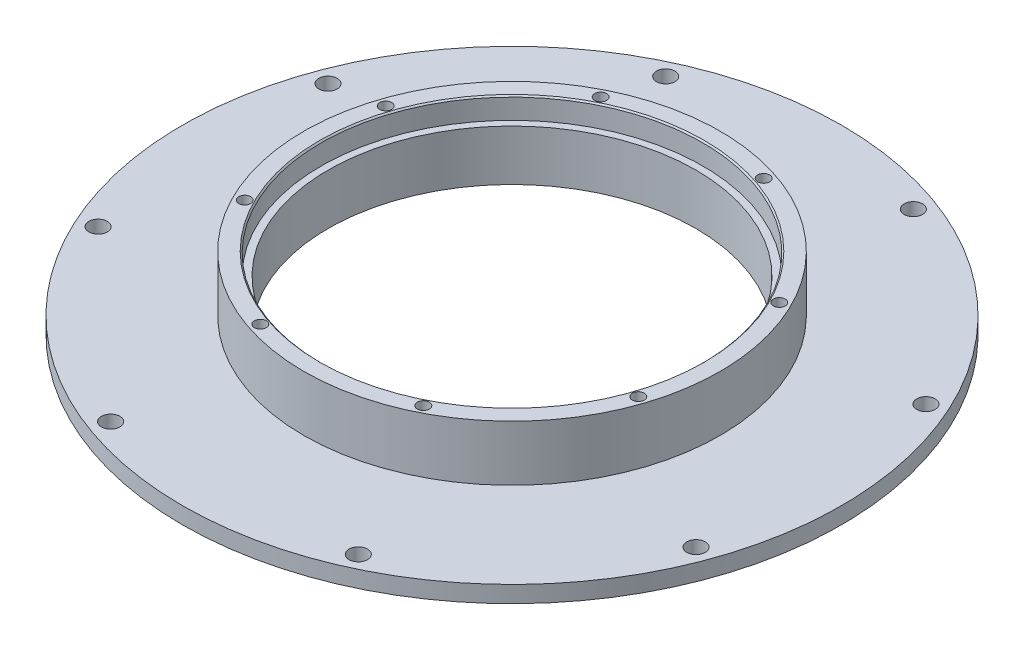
ISO-10303-21;
HEADER;
FILE_DESCRIPTION(('STEP AP214'),'2;1');
FILE_NAME('part.step','',(''),(''),'','','');
FILE_SCHEMA(('AUTOMOTIVE_DESIGN { 1 0 10303 214 1 1 1 1 }'));
ENDSEC;
DATA;
#1=APPLICATION_CONTEXT('core data for automotive mechanical design processes');
#2=APPLICATION_PROTOCOL_DEFINITION('international standard','automotive_design',2000,#1);
#3=PRODUCT_CONTEXT('',#1,'mechanical');
#4=PRODUCT('Part','Part','',(#3));
#5=PRODUCT_RELATED_PRODUCT_CATEGORY('part','',(#4));
#6=PRODUCT_DEFINITION_FORMATION('','',#4);
#7=PRODUCT_DEFINITION_CONTEXT('part definition',#1,'design');
#8=PRODUCT_DEFINITION('design','',#6,#7);
#9=PRODUCT_DEFINITION_SHAPE('','',#8);
#10=(LENGTH_UNIT() NAMED_UNIT(*) SI_UNIT(.MILLI.,.METRE.));
#11=(NAMED_UNIT(*) PLANE_ANGLE_UNIT() SI_UNIT($,.RADIAN.));
#12=(NAMED_UNIT(*) SI_UNIT($,.STERADIAN.) SOLID_ANGLE_UNIT());
#13=UNCERTAINTY_MEASURE_WITH_UNIT(LENGTH_MEASURE(1.E-05),#10,'distance_accuracy_value','');
#14=(GEOMETRIC_REPRESENTATION_CONTEXT(3) GLOBAL_UNCERTAINTY_ASSIGNED_CONTEXT((#13)) GLOBAL_UNIT_ASSIGNED_CONTEXT((#10,
#11,#12)) REPRESENTATION_CONTEXT('',''));
#15=CARTESIAN_POINT('',(0.,0.,0.));
#16=DIRECTION('',(0.,0.,1.));
#17=DIRECTION('',(1.,0.,0.));
#18=AXIS2_PLACEMENT_3D('',#15,#16,#17);
#19=CARTESIAN_POINT('',(0.,0.,0.));
#20=DIRECTION('',(0.,1.,0.));
#21=DIRECTION('',(0.,0.,1.));
#22=AXIS2_PLACEMENT_3D('',#19,#20,#21);
#23=CYLINDRICAL_SURFACE('',#22,67.31);
#24=CARTESIAN_POINT('',(0.,22.987,0.));
#25=DIRECTION('',(0.,1.,0.));
#26=DIRECTION('',(0.,0.,1.));
#27=AXIS2_PLACEMENT_3D('',#24,#25,#26);
#28=CIRCLE('',#27,67.31);
#29=CARTESIAN_POINT('',(0.,22.987,67.31));
#30=VERTEX_POINT('',#29);
#31=EDGE_CURVE('E167',#30,#30,#28,.F.);
#32=ORIENTED_EDGE('',*,*,#31,.F.);
#33=EDGE_LOOP('',(#32));
#34=FACE_BOUND('',#33,.T.);
#35=CARTESIAN_POINT('',(0.,4.445,0.));
#36=DIRECTION('',(0.,-1.,0.));
#37=DIRECTION('',(0.,0.,-1.));
#38=AXIS2_PLACEMENT_3D('',#35,#36,#37);
#39=CIRCLE('',#38,67.31);
#40=CARTESIAN_POINT('',(0.,4.445,-67.31));
#41=VERTEX_POINT('',#40);
#42=EDGE_CURVE('E44',#41,#41,#39,.F.);
#43=ORIENTED_EDGE('',*,*,#42,.F.);
#44=EDGE_LOOP('',(#43));
#45=FACE_BOUND('',#44,.T.);
#46=ADVANCED_FACE('F40',(#34,#45),#23,.F.);
#47=CARTESIAN_POINT('',(0.,30.861,0.));
#48=DIRECTION('',(0.,-1.,0.));
#49=DIRECTION('',(0.,0.,-1.));
#50=AXIS2_PLACEMENT_3D('',#47,#48,#49);
#51=CYLINDRICAL_SURFACE('',#50,120.65);
#52=CARTESIAN_POINT('',(0.,10.541,0.));
#53=DIRECTION('',(0.,1.,0.));
#54=DIRECTION('',(0.,0.,1.));
#55=AXIS2_PLACEMENT_3D('',#52,#53,#54);
#56=CIRCLE('',#55,120.65);
#57=CARTESIAN_POINT('',(0.,10.541,120.65));
#58=VERTEX_POINT('',#57);
#59=EDGE_CURVE('E161',#58,#58,#56,.T.);
#60=ORIENTED_EDGE('',*,*,#59,.F.);
#61=EDGE_LOOP('',(#60));
#62=FACE_BOUND('',#61,.T.);
#63=CARTESIAN_POINT('',(0.,4.445,0.));
#64=DIRECTION('',(0.,-1.,0.));
#65=DIRECTION('',(0.,0.,-1.));
#66=AXIS2_PLACEMENT_3D('',#63,#64,#65);
#67=CIRCLE('',#66,120.65);
#68=CARTESIAN_POINT('',(0.,4.445,-120.65));
#69=VERTEX_POINT('',#68);
#70=EDGE_CURVE('E91',#69,#69,#67,.T.);
#71=ORIENTED_EDGE('',*,*,#70,.F.);
#72=EDGE_LOOP('',(#71));
#73=FACE_BOUND('',#72,.T.);
#74=ADVANCED_FACE('F204',(#62,#73),#51,.T.);
#75=CARTESIAN_POINT('',(0.,0.,0.));
#76=DIRECTION('',(0.,1.,0.));
#77=DIRECTION('',(0.,0.,1.));
#78=AXIS2_PLACEMENT_3D('',#75,#76,#77);
#79=PLANE('',#78);
#80=CARTESIAN_POINT('',(0.,0.,0.));
#81=DIRECTION('',(0.,-1.,0.));
#82=DIRECTION('',(0.,0.,-1.));
#83=AXIS2_PLACEMENT_3D('',#80,#81,#82);
#84=CIRCLE('',#83,105.664);
#85=CARTESIAN_POINT('',(0.,0.,-105.664));
#86=VERTEX_POINT('',#85);
#87=EDGE_CURVE('E351',#86,#86,#84,.T.);
#88=ORIENTED_EDGE('',*,*,#87,.F.);
#89=EDGE_LOOP('',(#88));
#90=FACE_BOUND('',#89,.T.);
#91=CARTESIAN_POINT('',(0.,0.,0.));
#92=DIRECTION('',(0.,1.,0.));
#93=DIRECTION('',(0.,0.,1.));
#94=AXIS2_PLACEMENT_3D('',#91,#92,#93);
#95=CIRCLE('',#94,107.95);
#96=CARTESIAN_POINT('',(0.,0.,107.95));
#97=VERTEX_POINT('',#96);
#98=EDGE_CURVE('E49',#97,#97,#95,.F.);
#99=ORIENTED_EDGE('',*,*,#98,.T.);
#100=EDGE_LOOP('',(#99));
#101=FACE_BOUND('',#100,.T.);
#102=ADVANCED_FACE('F186',(#90,#101),#79,.F.);
#103=CARTESIAN_POINT('',(-39.7893544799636,10.541,107.150815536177));
#104=DIRECTION('',(0.,1.,0.));
#105=DIRECTION('',(0.,0.,1.));
#106=AXIS2_PLACEMENT_3D('',#103,#104,#105);
#107=CYLINDRICAL_SURFACE('',#106,3.3782);
#108=CARTESIAN_POINT('',(-39.7893544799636,10.541,107.150815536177));
#109=DIRECTION('',(0.,1.,0.));
#110=DIRECTION('',(0.,0.,1.));
#111=AXIS2_PLACEMENT_3D('',#108,#109,#110);
#112=CIRCLE('',#111,3.3782);
#113=CARTESIAN_POINT('',(-39.7893544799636,10.541,110.529015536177));
#114=VERTEX_POINT('',#113);
#115=EDGE_CURVE('E154',#114,#114,#112,.T.);
#116=ORIENTED_EDGE('',*,*,#115,.T.);
#117=EDGE_LOOP('',(#116));
#118=FACE_BOUND('',#117,.T.);
#119=CARTESIAN_POINT('',(-39.7893544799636,4.445,107.150815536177));
#120=DIRECTION('',(0.,-1.,0.));
#121=DIRECTION('',(0.,0.,-1.));
#122=AXIS2_PLACEMENT_3D('',#119,#120,#121);
#123=CIRCLE('',#122,3.3782);
#124=CARTESIAN_POINT('',(-39.7893544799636,4.445,103.772615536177));
#125=VERTEX_POINT('',#124);
#126=EDGE_CURVE('E374',#125,#125,#123,.F.);
#127=ORIENTED_EDGE('',*,*,#126,.F.);
#128=EDGE_LOOP('',(#127));
#129=FACE_BOUND('',#128,.T.);
#130=ADVANCED_FACE('F225',(#118,#129),#107,.F.);
#131=CARTESIAN_POINT('',(47.6317459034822,10.541,103.902390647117));
#132=DIRECTION('',(0.,1.,0.));
#133=DIRECTION('',(0.,0.,1.));
#134=AXIS2_PLACEMENT_3D('',#131,#132,#133);
#135=CYLINDRICAL_SURFACE('',#134,3.3782);
#136=CARTESIAN_POINT('',(47.6317459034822,10.541,103.902390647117));
#137=DIRECTION('',(0.,1.,0.));
#138=DIRECTION('',(0.,0.,1.));
#139=AXIS2_PLACEMENT_3D('',#136,#137,#138);
#140=CIRCLE('',#139,3.3782);
#141=CARTESIAN_POINT('',(47.6317459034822,10.541,107.280590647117));
#142=VERTEX_POINT('',#141);
#143=EDGE_CURVE('E151',#142,#142,#140,.T.);
#144=ORIENTED_EDGE('',*,*,#143,.T.);
#145=EDGE_LOOP('',(#144));
#146=FACE_BOUND('',#145,.T.);
#147=CARTESIAN_POINT('',(47.6317459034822,4.445,103.902390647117));
#148=DIRECTION('',(0.,-1.,0.));
#149=DIRECTION('',(0.,0.,-1.));
#150=AXIS2_PLACEMENT_3D('',#147,#148,#149);
#151=CIRCLE('',#150,3.3782);
#152=CARTESIAN_POINT('',(47.6317459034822,4.445,100.524190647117));
#153=VERTEX_POINT('',#152);
#154=EDGE_CURVE('E371',#153,#153,#151,.F.);
#155=ORIENTED_EDGE('',*,*,#154,.F.);
#156=EDGE_LOOP('',(#155));
#157=FACE_BOUND('',#156,.T.);
#158=ADVANCED_FACE('F261',(#146,#157),#135,.F.);
#159=CARTESIAN_POINT('',(107.150815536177,10.541,39.7893544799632));
#160=DIRECTION('',(0.,1.,0.));
#161=DIRECTION('',(0.,0.,1.));
#162=AXIS2_PLACEMENT_3D('',#159,#160,#161);
#163=CYLINDRICAL_SURFACE('',#162,3.3782);
#164=CARTESIAN_POINT('',(107.150815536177,10.541,39.7893544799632));
#165=DIRECTION('',(0.,1.,0.));
#166=DIRECTION('',(0.,0.,1.));
#167=AXIS2_PLACEMENT_3D('',#164,#165,#166);
#168=CIRCLE('',#167,3.3782);
#169=CARTESIAN_POINT('',(107.150815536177,10.541,43.1675544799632));
#170=VERTEX_POINT('',#169);
#171=EDGE_CURVE('E148',#170,#170,#168,.T.);
#172=ORIENTED_EDGE('',*,*,#171,.T.);
#173=EDGE_LOOP('',(#172));
#174=FACE_BOUND('',#173,.T.);
#175=CARTESIAN_POINT('',(107.150815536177,4.445,39.7893544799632));
#176=DIRECTION('',(0.,-1.,0.));
#177=DIRECTION('',(0.,0.,-1.));
#178=AXIS2_PLACEMENT_3D('',#175,#176,#177);
#179=CIRCLE('',#178,3.3782);
#180=CARTESIAN_POINT('',(107.150815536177,4.445,36.4111544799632));
#181=VERTEX_POINT('',#180);
#182=EDGE_CURVE('E368',#181,#181,#179,.F.);
#183=ORIENTED_EDGE('',*,*,#182,.F.);
#184=EDGE_LOOP('',(#183));
#185=FACE_BOUND('',#184,.T.);
#186=ADVANCED_FACE('F265',(#174,#185),#163,.F.);
#187=CARTESIAN_POINT('',(103.902390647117,10.541,-47.6317459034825));
#188=DIRECTION('',(0.,1.,0.));
#189=DIRECTION('',(0.,0.,1.));
#190=AXIS2_PLACEMENT_3D('',#187,#188,#189);
#191=CYLINDRICAL_SURFACE('',#190,3.3782);
#192=CARTESIAN_POINT('',(103.902390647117,10.541,-47.6317459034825));
#193=DIRECTION('',(0.,1.,0.));
#194=DIRECTION('',(0.,0.,1.));
#195=AXIS2_PLACEMENT_3D('',#192,#193,#194);
#196=CIRCLE('',#195,3.3782);
#197=CARTESIAN_POINT('',(103.902390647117,10.541,-44.2535459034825));
#198=VERTEX_POINT('',#197);
#199=EDGE_CURVE('E145',#198,#198,#196,.T.);
#200=ORIENTED_EDGE('',*,*,#199,.T.);
#201=EDGE_LOOP('',(#200));
#202=FACE_BOUND('',#201,.T.);
#203=CARTESIAN_POINT('',(103.902390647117,4.445,-47.6317459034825));
#204=DIRECTION('',(0.,-1.,0.));
#205=DIRECTION('',(0.,0.,-1.));
#206=AXIS2_PLACEMENT_3D('',#203,#204,#205);
#207=CIRCLE('',#206,3.3782);
#208=CARTESIAN_POINT('',(103.902390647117,4.445,-51.0099459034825));
#209=VERTEX_POINT('',#208);
#210=EDGE_CURVE('E365',#209,#209,#207,.F.);
#211=ORIENTED_EDGE('',*,*,#210,.F.);
#212=EDGE_LOOP('',(#211));
#213=FACE_BOUND('',#212,.T.);
#214=ADVANCED_FACE('F269',(#202,#213),#191,.F.);
#215=CARTESIAN_POINT('',(39.7893544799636,10.541,-107.150815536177));
#216=DIRECTION('',(0.,1.,0.));
#217=DIRECTION('',(0.,0.,1.));
#218=AXIS2_PLACEMENT_3D('',#215,#216,#217);
#219=CYLINDRICAL_SURFACE('',#218,3.3782);
#220=CARTESIAN_POINT('',(39.7893544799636,10.541,-107.150815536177));
#221=DIRECTION('',(0.,1.,0.));
#222=DIRECTION('',(0.,0.,1.));
#223=AXIS2_PLACEMENT_3D('',#220,#221,#222);
#224=CIRCLE('',#223,3.3782);
#225=CARTESIAN_POINT('',(39.7893544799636,10.541,-103.772615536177));
#226=VERTEX_POINT('',#225);
#227=EDGE_CURVE('E142',#226,#226,#224,.T.);
#228=ORIENTED_EDGE('',*,*,#227,.T.);
#229=EDGE_LOOP('',(#228));
#230=FACE_BOUND('',#229,.T.);
#231=CARTESIAN_POINT('',(39.7893544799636,4.445,-107.150815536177));
#232=DIRECTION('',(0.,-1.,0.));
#233=DIRECTION('',(0.,0.,-1.));
#234=AXIS2_PLACEMENT_3D('',#231,#232,#233);
#235=CIRCLE('',#234,3.3782);
#236=CARTESIAN_POINT('',(39.7893544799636,4.445,-110.529015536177));
#237=VERTEX_POINT('',#236);
#238=EDGE_CURVE('E362',#237,#237,#235,.F.);
#239=ORIENTED_EDGE('',*,*,#238,.F.);
#240=EDGE_LOOP('',(#239));
#241=FACE_BOUND('',#240,.T.);
#242=ADVANCED_FACE('F273',(#230,#241),#219,.F.);
#243=CARTESIAN_POINT('',(-47.6317459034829,10.541,-103.902390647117));
#244=DIRECTION('',(0.,1.,0.));
#245=DIRECTION('',(0.,0.,1.));
#246=AXIS2_PLACEMENT_3D('',#243,#244,#245);
#247=CYLINDRICAL_SURFACE('',#246,3.3782);
#248=CARTESIAN_POINT('',(-47.6317459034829,10.541,-103.902390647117));
#249=DIRECTION('',(0.,1.,0.));
#250=DIRECTION('',(0.,0.,1.));
#251=AXIS2_PLACEMENT_3D('',#248,#249,#250);
#252=CIRCLE('',#251,3.3782);
#253=CARTESIAN_POINT('',(-47.6317459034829,10.541,-100.524190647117));
#254=VERTEX_POINT('',#253);
#255=EDGE_CURVE('E139',#254,#254,#252,.T.);
#256=ORIENTED_EDGE('',*,*,#255,.T.);
#257=EDGE_LOOP('',(#256));
#258=FACE_BOUND('',#257,.T.);
#259=CARTESIAN_POINT('',(-47.6317459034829,4.445,-103.902390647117));
#260=DIRECTION('',(0.,-1.,0.));
#261=DIRECTION('',(0.,0.,-1.));
#262=AXIS2_PLACEMENT_3D('',#259,#260,#261);
#263=CIRCLE('',#262,3.3782);
#264=CARTESIAN_POINT('',(-47.6317459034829,4.445,-107.280590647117));
#265=VERTEX_POINT('',#264);
#266=EDGE_CURVE('E359',#265,#265,#263,.F.);
#267=ORIENTED_EDGE('',*,*,#266,.F.);
#268=EDGE_LOOP('',(#267));
#269=FACE_BOUND('',#268,.T.);
#270=ADVANCED_FACE('F277',(#258,#269),#247,.F.);
#271=CARTESIAN_POINT('',(-107.150815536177,10.541,-39.7893544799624));
#272=DIRECTION('',(0.,1.,0.));
#273=DIRECTION('',(0.,0.,1.));
#274=AXIS2_PLACEMENT_3D('',#271,#272,#273);
#275=CYLINDRICAL_SURFACE('',#274,3.3782);
#276=CARTESIAN_POINT('',(-107.150815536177,10.541,-39.7893544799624));
#277=DIRECTION('',(0.,1.,0.));
#278=DIRECTION('',(0.,0.,1.));
#279=AXIS2_PLACEMENT_3D('',#276,#277,#278);
#280=CIRCLE('',#279,3.3782);
#281=CARTESIAN_POINT('',(-107.150815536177,10.541,-36.4111544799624));
#282=VERTEX_POINT('',#281);
#283=EDGE_CURVE('E136',#282,#282,#280,.T.);
#284=ORIENTED_EDGE('',*,*,#283,.T.);
#285=EDGE_LOOP('',(#284));
#286=FACE_BOUND('',#285,.T.);
#287=CARTESIAN_POINT('',(-107.150815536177,4.445,-39.7893544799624));
#288=DIRECTION('',(0.,-1.,0.));
#289=DIRECTION('',(0.,0.,-1.));
#290=AXIS2_PLACEMENT_3D('',#287,#288,#289);
#291=CIRCLE('',#290,3.3782);
#292=CARTESIAN_POINT('',(-107.150815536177,4.445,-43.1675544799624));
#293=VERTEX_POINT('',#292);
#294=EDGE_CURVE('E181',#293,#293,#291,.F.);
#295=ORIENTED_EDGE('',*,*,#294,.F.);
#296=EDGE_LOOP('',(#295));
#297=FACE_BOUND('',#296,.T.);
#298=ADVANCED_FACE('F281',(#286,#297),#275,.F.);
#299=CARTESIAN_POINT('',(-103.902390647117,10.541,47.6317459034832));
#300=DIRECTION('',(0.,1.,0.));
#301=DIRECTION('',(0.,0.,1.));
#302=AXIS2_PLACEMENT_3D('',#299,#300,#301);
#303=CYLINDRICAL_SURFACE('',#302,3.3782);
#304=CARTESIAN_POINT('',(-103.902390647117,10.541,47.6317459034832));
#305=DIRECTION('',(0.,1.,0.));
#306=DIRECTION('',(0.,0.,1.));
#307=AXIS2_PLACEMENT_3D('',#304,#305,#306);
#308=CIRCLE('',#307,3.3782);
#309=CARTESIAN_POINT('',(-103.902390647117,10.541,51.0099459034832));
#310=VERTEX_POINT('',#309);
#311=EDGE_CURVE('E133',#310,#310,#308,.T.);
#312=ORIENTED_EDGE('',*,*,#311,.T.);
#313=EDGE_LOOP('',(#312));
#314=FACE_BOUND('',#313,.T.);
#315=CARTESIAN_POINT('',(-103.902390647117,4.445,47.6317459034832));
#316=DIRECTION('',(0.,-1.,0.));
#317=DIRECTION('',(0.,0.,-1.));
#318=AXIS2_PLACEMENT_3D('',#315,#316,#317);
#319=CIRCLE('',#318,3.3782);
#320=CARTESIAN_POINT('',(-103.902390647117,4.445,44.2535459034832));
#321=VERTEX_POINT('',#320);
#322=EDGE_CURVE('E178',#321,#321,#319,.F.);
#323=ORIENTED_EDGE('',*,*,#322,.F.);
#324=EDGE_LOOP('',(#323));
#325=FACE_BOUND('',#324,.T.);
#326=ADVANCED_FACE('F222',(#314,#325),#303,.F.);
#327=CARTESIAN_POINT('',(0.,30.861,0.));
#328=DIRECTION('',(0.,1.,0.));
#329=DIRECTION('',(0.,0.,1.));
#330=AXIS2_PLACEMENT_3D('',#327,#328,#329);
#331=PLANE('',#330);
#332=CARTESIAN_POINT('',(0.,30.861,0.));
#333=DIRECTION('',(0.,1.,0.));
#334=DIRECTION('',(0.,0.,1.));
#335=AXIS2_PLACEMENT_3D('',#332,#333,#334);
#336=CIRCLE('',#335,70.3707);
#337=CARTESIAN_POINT('',(0.,30.861,70.3707));
#338=VERTEX_POINT('',#337);
#339=EDGE_CURVE('E175',#338,#338,#336,.F.);
#340=ORIENTED_EDGE('',*,*,#339,.T.);
#341=EDGE_LOOP('',(#340));
#342=FACE_BOUND('',#341,.T.);
#343=CARTESIAN_POINT('',(-69.1887343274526,30.861,-22.9572961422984));
#344=DIRECTION('',(0.,1.,0.));
#345=DIRECTION('',(0.,0.,1.));
#346=AXIS2_PLACEMENT_3D('',#343,#344,#345);
#347=CIRCLE('',#346,2.19709999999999);
#348=CARTESIAN_POINT('',(-69.1887343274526,30.861,-20.7601961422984));
#349=VERTEX_POINT('',#348);
#350=EDGE_CURVE('E85',#349,#349,#347,.T.);
#351=ORIENTED_EDGE('',*,*,#350,.F.);
#352=EDGE_LOOP('',(#351));
#353=FACE_BOUND('',#352,.T.);
#354=CARTESIAN_POINT('',(-32.6905634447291,30.861,-65.1570830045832));
#355=DIRECTION('',(0.,1.,0.));
#356=DIRECTION('',(0.,0.,1.));
#357=AXIS2_PLACEMENT_3D('',#354,#355,#356);
#358=CIRCLE('',#357,2.19709999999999);
#359=CARTESIAN_POINT('',(-32.6905634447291,30.861,-62.9599830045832));
#360=VERTEX_POINT('',#359);
#361=EDGE_CURVE('E84',#360,#360,#358,.T.);
#362=ORIENTED_EDGE('',*,*,#361,.F.);
#363=EDGE_LOOP('',(#362));
#364=FACE_BOUND('',#363,.T.);
#365=CARTESIAN_POINT('',(22.9572961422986,30.861,-69.1887343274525));
#366=DIRECTION('',(0.,1.,0.));
#367=DIRECTION('',(0.,0.,1.));
#368=AXIS2_PLACEMENT_3D('',#365,#366,#367);
#369=CIRCLE('',#368,2.19709999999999);
#370=CARTESIAN_POINT('',(22.9572961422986,30.861,-66.9916343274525));
#371=VERTEX_POINT('',#370);
#372=EDGE_CURVE('E97',#371,#371,#369,.T.);
#373=ORIENTED_EDGE('',*,*,#372,.F.);
#374=EDGE_LOOP('',(#373));
#375=FACE_BOUND('',#374,.T.);
#376=CARTESIAN_POINT('',(65.1570830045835,30.861,-32.6905634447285));
#377=DIRECTION('',(0.,1.,0.));
#378=DIRECTION('',(0.,0.,1.));
#379=AXIS2_PLACEMENT_3D('',#376,#377,#378);
#380=CIRCLE('',#379,2.19709999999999);
#381=CARTESIAN_POINT('',(65.1570830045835,30.861,-30.4934634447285));
#382=VERTEX_POINT('',#381);
#383=EDGE_CURVE('E103',#382,#382,#380,.T.);
#384=ORIENTED_EDGE('',*,*,#383,.F.);
#385=EDGE_LOOP('',(#384));
#386=FACE_BOUND('',#385,.T.);
#387=CARTESIAN_POINT('',(69.1887343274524,30.861,22.9572961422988));
#388=DIRECTION('',(0.,1.,0.));
#389=DIRECTION('',(0.,0.,1.));
#390=AXIS2_PLACEMENT_3D('',#387,#388,#389);
#391=CIRCLE('',#390,2.19709999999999);
#392=CARTESIAN_POINT('',(69.1887343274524,30.861,25.1543961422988));
#393=VERTEX_POINT('',#392);
#394=EDGE_CURVE('E109',#393,#393,#391,.T.);
#395=ORIENTED_EDGE('',*,*,#394,.F.);
#396=EDGE_LOOP('',(#395));
#397=FACE_BOUND('',#396,.T.);
#398=CARTESIAN_POINT('',(32.6905634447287,30.861,65.1570830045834));
#399=DIRECTION('',(0.,1.,0.));
#400=DIRECTION('',(0.,0.,1.));
#401=AXIS2_PLACEMENT_3D('',#398,#399,#400);
#402=CIRCLE('',#401,2.19709999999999);
#403=CARTESIAN_POINT('',(32.6905634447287,30.861,67.3541830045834));
#404=VERTEX_POINT('',#403);
#405=EDGE_CURVE('E115',#404,#404,#402,.T.);
#406=ORIENTED_EDGE('',*,*,#405,.F.);
#407=EDGE_LOOP('',(#406));
#408=FACE_BOUND('',#407,.T.);
#409=CARTESIAN_POINT('',(-22.9572961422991,30.861,69.1887343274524));
#410=DIRECTION('',(0.,1.,0.));
#411=DIRECTION('',(0.,0.,1.));
#412=AXIS2_PLACEMENT_3D('',#409,#410,#411);
#413=CIRCLE('',#412,2.19709999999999);
#414=CARTESIAN_POINT('',(-22.9572961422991,30.861,71.3858343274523));
#415=VERTEX_POINT('',#414);
#416=EDGE_CURVE('E121',#415,#415,#413,.T.);
#417=ORIENTED_EDGE('',*,*,#416,.F.);
#418=EDGE_LOOP('',(#417));
#419=FACE_BOUND('',#418,.T.);
#420=CARTESIAN_POINT('',(-65.1570830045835,30.861,32.6905634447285));
#421=DIRECTION('',(0.,1.,0.));
#422=DIRECTION('',(0.,0.,1.));
#423=AXIS2_PLACEMENT_3D('',#420,#421,#422);
#424=CIRCLE('',#423,2.19709999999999);
#425=CARTESIAN_POINT('',(-65.1570830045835,30.861,34.8876634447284));
#426=VERTEX_POINT('',#425);
#427=EDGE_CURVE('E127',#426,#426,#424,.T.);
#428=ORIENTED_EDGE('',*,*,#427,.F.);
#429=EDGE_LOOP('',(#428));
#430=FACE_BOUND('',#429,.T.);
#431=CARTESIAN_POINT('',(0.,30.861,0.));
#432=DIRECTION('',(0.,1.,0.));
#433=DIRECTION('',(0.,0.,1.));
#434=AXIS2_PLACEMENT_3D('',#431,#432,#433);
#435=CIRCLE('',#434,76.2);
#436=CARTESIAN_POINT('',(0.,30.861,76.2));
#437=VERTEX_POINT('',#436);
#438=EDGE_CURVE('E157',#437,#437,#435,.T.);
#439=ORIENTED_EDGE('',*,*,#438,.T.);
#440=EDGE_LOOP('',(#439));
#441=FACE_BOUND('',#440,.T.);
#442=ADVANCED_FACE('F218',(#342,#353,#364,#375,#386,#397,#408,#419,#430,#441),#331,.T.);
#443=CARTESIAN_POINT('',(0.,22.987,0.));
#444=DIRECTION('',(0.,1.,0.));
#445=DIRECTION('',(0.,0.,1.));
#446=AXIS2_PLACEMENT_3D('',#443,#444,#445);
#447=PLANE('',#446);
#448=CARTESIAN_POINT('',(0.,22.987,0.));
#449=DIRECTION('',(0.,1.,0.));
#450=DIRECTION('',(0.,0.,1.));
#451=AXIS2_PLACEMENT_3D('',#448,#449,#450);
#452=CIRCLE('',#451,69.8627);
#453=CARTESIAN_POINT('',(0.,22.987,69.8627));
#454=VERTEX_POINT('',#453);
#455=EDGE_CURVE('E164',#454,#454,#452,.T.);
#456=ORIENTED_EDGE('',*,*,#455,.T.);
#457=EDGE_LOOP('',(#456));
#458=FACE_BOUND('',#457,.T.);
#459=ORIENTED_EDGE('',*,*,#31,.T.);
#460=EDGE_LOOP('',(#459));
#461=FACE_BOUND('',#460,.T.);
#462=ADVANCED_FACE('F221',(#458,#461),#447,.T.);
#463=CARTESIAN_POINT('',(0.,22.987,0.));
#464=DIRECTION('',(0.,1.,0.));
#465=DIRECTION('',(0.,0.,1.));
#466=AXIS2_PLACEMENT_3D('',#463,#464,#465);
#467=CYLINDRICAL_SURFACE('',#466,69.8627);
#468=CARTESIAN_POINT('',(0.,30.353,0.));
#469=DIRECTION('',(0.,1.,0.));
#470=DIRECTION('',(0.,0.,1.));
#471=AXIS2_PLACEMENT_3D('',#468,#469,#470);
#472=CIRCLE('',#471,69.8627);
#473=CARTESIAN_POINT('',(0.,30.353,69.8627));
#474=VERTEX_POINT('',#473);
#475=EDGE_CURVE('E170',#474,#474,#472,.T.);
#476=ORIENTED_EDGE('',*,*,#475,.T.);
#477=EDGE_LOOP('',(#476));
#478=FACE_BOUND('',#477,.T.);
#479=ORIENTED_EDGE('',*,*,#455,.F.);
#480=EDGE_LOOP('',(#479));
#481=FACE_BOUND('',#480,.T.);
#482=ADVANCED_FACE('F216',(#478,#481),#467,.F.);
#483=CARTESIAN_POINT('',(0.,10.541,0.));
#484=DIRECTION('',(0.,1.,0.));
#485=DIRECTION('',(0.,0.,1.));
#486=AXIS2_PLACEMENT_3D('',#483,#484,#485);
#487=PLANE('',#486);
#488=ORIENTED_EDGE('',*,*,#311,.F.);
#489=EDGE_LOOP('',(#488));
#490=FACE_BOUND('',#489,.T.);
#491=ORIENTED_EDGE('',*,*,#283,.F.);
#492=EDGE_LOOP('',(#491));
#493=FACE_BOUND('',#492,.T.);
#494=ORIENTED_EDGE('',*,*,#255,.F.);
#495=EDGE_LOOP('',(#494));
#496=FACE_BOUND('',#495,.T.);
#497=ORIENTED_EDGE('',*,*,#227,.F.);
#498=EDGE_LOOP('',(#497));
#499=FACE_BOUND('',#498,.T.);
#500=ORIENTED_EDGE('',*,*,#199,.F.);
#501=EDGE_LOOP('',(#500));
#502=FACE_BOUND('',#501,.T.);
#503=ORIENTED_EDGE('',*,*,#171,.F.);
#504=EDGE_LOOP('',(#503));
#505=FACE_BOUND('',#504,.T.);
#506=ORIENTED_EDGE('',*,*,#143,.F.);
#507=EDGE_LOOP('',(#506));
#508=FACE_BOUND('',#507,.T.);
#509=ORIENTED_EDGE('',*,*,#115,.F.);
#510=EDGE_LOOP('',(#509));
#511=FACE_BOUND('',#510,.T.);
#512=CARTESIAN_POINT('',(0.,10.541,0.));
#513=DIRECTION('',(0.,1.,0.));
#514=DIRECTION('',(0.,0.,1.));
#515=AXIS2_PLACEMENT_3D('',#512,#513,#514);
#516=CIRCLE('',#515,76.2);
#517=CARTESIAN_POINT('',(0.,10.541,76.2));
#518=VERTEX_POINT('',#517);
#519=EDGE_CURVE('E158',#518,#518,#516,.T.);
#520=ORIENTED_EDGE('',*,*,#519,.F.);
#521=EDGE_LOOP('',(#520));
#522=FACE_BOUND('',#521,.T.);
#523=ORIENTED_EDGE('',*,*,#59,.T.);
#524=EDGE_LOOP('',(#523));
#525=FACE_BOUND('',#524,.T.);
#526=ADVANCED_FACE('F243',(#490,#493,#496,#499,#502,#505,#508,#511,#522,#525),#487,.T.);
#527=CARTESIAN_POINT('',(0.,10.541,0.));
#528=DIRECTION('',(0.,1.,0.));
#529=DIRECTION('',(0.,0.,1.));
#530=AXIS2_PLACEMENT_3D('',#527,#528,#529);
#531=CYLINDRICAL_SURFACE('',#530,76.2);
#532=ORIENTED_EDGE('',*,*,#519,.T.);
#533=EDGE_LOOP('',(#532));
#534=FACE_BOUND('',#533,.T.);
#535=ORIENTED_EDGE('',*,*,#438,.F.);
#536=EDGE_LOOP('',(#535));
#537=FACE_BOUND('',#536,.T.);
#538=ADVANCED_FACE('F253',(#534,#537),#531,.T.);
#539=CARTESIAN_POINT('',(-65.1570830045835,15.3416,32.6905634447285));
#540=DIRECTION('',(0.,1.,0.));
#541=DIRECTION('',(0.,0.,1.));
#542=AXIS2_PLACEMENT_3D('',#539,#540,#541);
#543=CONICAL_SURFACE('',#542,2.19709999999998,1.02974425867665);
#544=CARTESIAN_POINT('',(-65.1570830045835,14.0214491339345,32.6905634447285));
#545=VERTEX_POINT('',#544);
#546=VERTEX_LOOP('',#545);
#547=FACE_BOUND('',#546,.T.);
#548=CARTESIAN_POINT('',(-65.1570830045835,15.3416,32.6905634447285));
#549=DIRECTION('',(0.,1.,0.));
#550=DIRECTION('',(0.,0.,1.));
#551=AXIS2_PLACEMENT_3D('',#548,#549,#550);
#552=CIRCLE('',#551,2.19709999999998);
#553=CARTESIAN_POINT('',(-65.1570830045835,15.3416,34.8876634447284));
#554=VERTEX_POINT('',#553);
#555=EDGE_CURVE('E130',#554,#554,#552,.T.);
#556=ORIENTED_EDGE('',*,*,#555,.T.);
#557=EDGE_LOOP('',(#556));
#558=FACE_BOUND('',#557,.T.);
#559=ADVANCED_FACE('F257',(#547,#558),#543,.F.);
#560=CARTESIAN_POINT('',(-65.1570830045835,30.861,32.6905634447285));
#561=DIRECTION('',(0.,1.,0.));
#562=DIRECTION('',(0.,0.,1.));
#563=AXIS2_PLACEMENT_3D('',#560,#561,#562);
#564=CYLINDRICAL_SURFACE('',#563,2.19709999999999);
#565=ORIENTED_EDGE('',*,*,#555,.F.);
#566=EDGE_LOOP('',(#565));
#567=FACE_BOUND('',#566,.T.);
#568=ORIENTED_EDGE('',*,*,#427,.T.);
#569=EDGE_LOOP('',(#568));
#570=FACE_BOUND('',#569,.T.);
#571=ADVANCED_FACE('F291',(#567,#570),#564,.F.);
#572=CARTESIAN_POINT('',(-22.9572961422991,15.3416,69.1887343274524));
#573=DIRECTION('',(0.,1.,0.));
#574=DIRECTION('',(0.,0.,1.));
#575=AXIS2_PLACEMENT_3D('',#572,#573,#574);
#576=CONICAL_SURFACE('',#575,2.19709999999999,1.02974425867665);
#577=CARTESIAN_POINT('',(-22.9572961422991,14.0214491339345,69.1887343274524));
#578=VERTEX_POINT('',#577);
#579=VERTEX_LOOP('',#578);
#580=FACE_BOUND('',#579,.T.);
#581=CARTESIAN_POINT('',(-22.9572961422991,15.3416,69.1887343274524));
#582=DIRECTION('',(0.,1.,0.));
#583=DIRECTION('',(0.,0.,1.));
#584=AXIS2_PLACEMENT_3D('',#581,#582,#583);
#585=CIRCLE('',#584,2.19709999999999);
#586=CARTESIAN_POINT('',(-22.9572961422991,15.3416,71.3858343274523));
#587=VERTEX_POINT('',#586);
#588=EDGE_CURVE('E124',#587,#587,#585,.T.);
#589=ORIENTED_EDGE('',*,*,#588,.T.);
#590=EDGE_LOOP('',(#589));
#591=FACE_BOUND('',#590,.T.);
#592=ADVANCED_FACE('F294',(#580,#591),#576,.F.);
#593=CARTESIAN_POINT('',(-22.9572961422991,30.861,69.1887343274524));
#594=DIRECTION('',(0.,1.,0.));
#595=DIRECTION('',(0.,0.,1.));
#596=AXIS2_PLACEMENT_3D('',#593,#594,#595);
#597=CYLINDRICAL_SURFACE('',#596,2.19709999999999);
#598=ORIENTED_EDGE('',*,*,#588,.F.);
#599=EDGE_LOOP('',(#598));
#600=FACE_BOUND('',#599,.T.);
#601=ORIENTED_EDGE('',*,*,#416,.T.);
#602=EDGE_LOOP('',(#601));
#603=FACE_BOUND('',#602,.T.);
#604=ADVANCED_FACE('F298',(#600,#603),#597,.F.);
#605=CARTESIAN_POINT('',(32.6905634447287,15.3416,65.1570830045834));
#606=DIRECTION('',(0.,1.,0.));
#607=DIRECTION('',(0.,0.,1.));
#608=AXIS2_PLACEMENT_3D('',#605,#606,#607);
#609=CONICAL_SURFACE('',#608,2.19709999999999,1.02974425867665);
#610=CARTESIAN_POINT('',(32.6905634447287,14.0214491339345,65.1570830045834));
#611=VERTEX_POINT('',#610);
#612=VERTEX_LOOP('',#611);
#613=FACE_BOUND('',#612,.T.);
#614=CARTESIAN_POINT('',(32.6905634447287,15.3416,65.1570830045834));
#615=DIRECTION('',(0.,1.,0.));
#616=DIRECTION('',(0.,0.,1.));
#617=AXIS2_PLACEMENT_3D('',#614,#615,#616);
#618=CIRCLE('',#617,2.19709999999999);
#619=CARTESIAN_POINT('',(32.6905634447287,15.3416,67.3541830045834));
#620=VERTEX_POINT('',#619);
#621=EDGE_CURVE('E118',#620,#620,#618,.T.);
#622=ORIENTED_EDGE('',*,*,#621,.T.);
#623=EDGE_LOOP('',(#622));
#624=FACE_BOUND('',#623,.T.);
#625=ADVANCED_FACE('F301',(#613,#624),#609,.F.);
#626=CARTESIAN_POINT('',(32.6905634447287,30.861,65.1570830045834));
#627=DIRECTION('',(0.,1.,0.));
#628=DIRECTION('',(0.,0.,1.));
#629=AXIS2_PLACEMENT_3D('',#626,#627,#628);
#630=CYLINDRICAL_SURFACE('',#629,2.19709999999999);
#631=ORIENTED_EDGE('',*,*,#621,.F.);
#632=EDGE_LOOP('',(#631));
#633=FACE_BOUND('',#632,.T.);
#634=ORIENTED_EDGE('',*,*,#405,.T.);
#635=EDGE_LOOP('',(#634));
#636=FACE_BOUND('',#635,.T.);
#637=ADVANCED_FACE('F305',(#633,#636),#630,.F.);
#638=CARTESIAN_POINT('',(69.1887343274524,15.3416,22.9572961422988));
#639=DIRECTION('',(0.,1.,0.));
#640=DIRECTION('',(0.,0.,1.));
#641=AXIS2_PLACEMENT_3D('',#638,#639,#640);
#642=CONICAL_SURFACE('',#641,2.19709999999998,1.02974425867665);
#643=CARTESIAN_POINT('',(69.1887343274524,14.0214491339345,22.9572961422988));
#644=VERTEX_POINT('',#643);
#645=VERTEX_LOOP('',#644);
#646=FACE_BOUND('',#645,.T.);
#647=CARTESIAN_POINT('',(69.1887343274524,15.3416,22.9572961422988));
#648=DIRECTION('',(0.,1.,0.));
#649=DIRECTION('',(0.,0.,1.));
#650=AXIS2_PLACEMENT_3D('',#647,#648,#649);
#651=CIRCLE('',#650,2.19709999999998);
#652=CARTESIAN_POINT('',(69.1887343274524,15.3416,25.1543961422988));
#653=VERTEX_POINT('',#652);
#654=EDGE_CURVE('E112',#653,#653,#651,.T.);
#655=ORIENTED_EDGE('',*,*,#654,.T.);
#656=EDGE_LOOP('',(#655));
#657=FACE_BOUND('',#656,.T.);
#658=ADVANCED_FACE('F309',(#646,#657),#642,.F.);
#659=CARTESIAN_POINT('',(69.1887343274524,30.861,22.9572961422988));
#660=DIRECTION('',(0.,1.,0.));
#661=DIRECTION('',(0.,0.,1.));
#662=AXIS2_PLACEMENT_3D('',#659,#660,#661);
#663=CYLINDRICAL_SURFACE('',#662,2.19709999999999);
#664=ORIENTED_EDGE('',*,*,#654,.F.);
#665=EDGE_LOOP('',(#664));
#666=FACE_BOUND('',#665,.T.);
#667=ORIENTED_EDGE('',*,*,#394,.T.);
#668=EDGE_LOOP('',(#667));
#669=FACE_BOUND('',#668,.T.);
#670=ADVANCED_FACE('F313',(#666,#669),#663,.F.);
#671=CARTESIAN_POINT('',(65.1570830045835,15.3416,-32.6905634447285));
#672=DIRECTION('',(0.,1.,0.));
#673=DIRECTION('',(0.,0.,1.));
#674=AXIS2_PLACEMENT_3D('',#671,#672,#673);
#675=CONICAL_SURFACE('',#674,2.19709999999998,1.02974425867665);
#676=CARTESIAN_POINT('',(65.1570830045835,14.0214491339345,-32.6905634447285));
#677=VERTEX_POINT('',#676);
#678=VERTEX_LOOP('',#677);
#679=FACE_BOUND('',#678,.T.);
#680=CARTESIAN_POINT('',(65.1570830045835,15.3416,-32.6905634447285));
#681=DIRECTION('',(0.,1.,0.));
#682=DIRECTION('',(0.,0.,1.));
#683=AXIS2_PLACEMENT_3D('',#680,#681,#682);
#684=CIRCLE('',#683,2.19709999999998);
#685=CARTESIAN_POINT('',(65.1570830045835,15.3416,-30.4934634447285));
#686=VERTEX_POINT('',#685);
#687=EDGE_CURVE('E106',#686,#686,#684,.T.);
#688=ORIENTED_EDGE('',*,*,#687,.T.);
#689=EDGE_LOOP('',(#688));
#690=FACE_BOUND('',#689,.T.);
#691=ADVANCED_FACE('F317',(#679,#690),#675,.F.);
#692=CARTESIAN_POINT('',(65.1570830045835,30.861,-32.6905634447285));
#693=DIRECTION('',(0.,1.,0.));
#694=DIRECTION('',(0.,0.,1.));
#695=AXIS2_PLACEMENT_3D('',#692,#693,#694);
#696=CYLINDRICAL_SURFACE('',#695,2.19709999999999);
#697=ORIENTED_EDGE('',*,*,#687,.F.);
#698=EDGE_LOOP('',(#697));
#699=FACE_BOUND('',#698,.T.);
#700=ORIENTED_EDGE('',*,*,#383,.T.);
#701=EDGE_LOOP('',(#700));
#702=FACE_BOUND('',#701,.T.);
#703=ADVANCED_FACE('F321',(#699,#702),#696,.F.);
#704=CARTESIAN_POINT('',(22.9572961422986,15.3416,-69.1887343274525));
#705=DIRECTION('',(0.,1.,0.));
#706=DIRECTION('',(0.,0.,1.));
#707=AXIS2_PLACEMENT_3D('',#704,#705,#706);
#708=CONICAL_SURFACE('',#707,2.19709999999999,1.02974425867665);
#709=CARTESIAN_POINT('',(22.9572961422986,14.0214491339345,-69.1887343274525));
#710=VERTEX_POINT('',#709);
#711=VERTEX_LOOP('',#710);
#712=FACE_BOUND('',#711,.T.);
#713=CARTESIAN_POINT('',(22.9572961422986,15.3416,-69.1887343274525));
#714=DIRECTION('',(0.,1.,0.));
#715=DIRECTION('',(0.,0.,1.));
#716=AXIS2_PLACEMENT_3D('',#713,#714,#715);
#717=CIRCLE('',#716,2.19709999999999);
#718=CARTESIAN_POINT('',(22.9572961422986,15.3416,-66.9916343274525));
#719=VERTEX_POINT('',#718);
#720=EDGE_CURVE('E100',#719,#719,#717,.T.);
#721=ORIENTED_EDGE('',*,*,#720,.T.);
#722=EDGE_LOOP('',(#721));
#723=FACE_BOUND('',#722,.T.);
#724=ADVANCED_FACE('F325',(#712,#723),#708,.F.);
#725=CARTESIAN_POINT('',(22.9572961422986,30.861,-69.1887343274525));
#726=DIRECTION('',(0.,1.,0.));
#727=DIRECTION('',(0.,0.,1.));
#728=AXIS2_PLACEMENT_3D('',#725,#726,#727);
#729=CYLINDRICAL_SURFACE('',#728,2.19709999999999);
#730=ORIENTED_EDGE('',*,*,#720,.F.);
#731=EDGE_LOOP('',(#730));
#732=FACE_BOUND('',#731,.T.);
#733=ORIENTED_EDGE('',*,*,#372,.T.);
#734=EDGE_LOOP('',(#733));
#735=FACE_BOUND('',#734,.T.);
#736=ADVANCED_FACE('F329',(#732,#735),#729,.F.);
#737=CARTESIAN_POINT('',(-32.6905634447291,15.3416,-65.1570830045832));
#738=DIRECTION('',(0.,1.,0.));
#739=DIRECTION('',(0.,0.,1.));
#740=AXIS2_PLACEMENT_3D('',#737,#738,#739);
#741=CONICAL_SURFACE('',#740,2.19709999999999,1.02974425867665);
#742=CARTESIAN_POINT('',(-32.6905634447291,14.0214491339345,-65.1570830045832));
#743=VERTEX_POINT('',#742);
#744=VERTEX_LOOP('',#743);
#745=FACE_BOUND('',#744,.T.);
#746=CARTESIAN_POINT('',(-32.6905634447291,15.3416,-65.1570830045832));
#747=DIRECTION('',(0.,1.,0.));
#748=DIRECTION('',(0.,0.,1.));
#749=AXIS2_PLACEMENT_3D('',#746,#747,#748);
#750=CIRCLE('',#749,2.19709999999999);
#751=CARTESIAN_POINT('',(-32.6905634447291,15.3416,-62.9599830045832));
#752=VERTEX_POINT('',#751);
#753=EDGE_CURVE('E88',#752,#752,#750,.T.);
#754=ORIENTED_EDGE('',*,*,#753,.T.);
#755=EDGE_LOOP('',(#754));
#756=FACE_BOUND('',#755,.T.);
#757=ADVANCED_FACE('F333',(#745,#756),#741,.F.);
#758=CARTESIAN_POINT('',(-32.6905634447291,30.861,-65.1570830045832));
#759=DIRECTION('',(0.,1.,0.));
#760=DIRECTION('',(0.,0.,1.));
#761=AXIS2_PLACEMENT_3D('',#758,#759,#760);
#762=CYLINDRICAL_SURFACE('',#761,2.19709999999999);
#763=ORIENTED_EDGE('',*,*,#753,.F.);
#764=EDGE_LOOP('',(#763));
#765=FACE_BOUND('',#764,.T.);
#766=ORIENTED_EDGE('',*,*,#361,.T.);
#767=EDGE_LOOP('',(#766));
#768=FACE_BOUND('',#767,.T.);
#769=ADVANCED_FACE('F78',(#765,#768),#762,.F.);
#770=CARTESIAN_POINT('',(-69.1887343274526,15.3416,-22.9572961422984));
#771=DIRECTION('',(0.,1.,0.));
#772=DIRECTION('',(0.,0.,1.));
#773=AXIS2_PLACEMENT_3D('',#770,#771,#772);
#774=CONICAL_SURFACE('',#773,2.19709999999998,1.02974425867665);
#775=CARTESIAN_POINT('',(-69.1887343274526,14.0214491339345,-22.9572961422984));
#776=VERTEX_POINT('',#775);
#777=VERTEX_LOOP('',#776);
#778=FACE_BOUND('',#777,.T.);
#779=CARTESIAN_POINT('',(-69.1887343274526,15.3416,-22.9572961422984));
#780=DIRECTION('',(0.,1.,0.));
#781=DIRECTION('',(0.,0.,1.));
#782=AXIS2_PLACEMENT_3D('',#779,#780,#781);
#783=CIRCLE('',#782,2.19709999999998);
#784=CARTESIAN_POINT('',(-69.1887343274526,15.3416,-20.7601961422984));
#785=VERTEX_POINT('',#784);
#786=EDGE_CURVE('E82',#785,#785,#783,.T.);
#787=ORIENTED_EDGE('',*,*,#786,.T.);
#788=EDGE_LOOP('',(#787));
#789=FACE_BOUND('',#788,.T.);
#790=ADVANCED_FACE('F74',(#778,#789),#774,.F.);
#791=CARTESIAN_POINT('',(-69.1887343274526,30.861,-22.9572961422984));
#792=DIRECTION('',(0.,1.,0.));
#793=DIRECTION('',(0.,0.,1.));
#794=AXIS2_PLACEMENT_3D('',#791,#792,#793);
#795=CYLINDRICAL_SURFACE('',#794,2.19709999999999);
#796=ORIENTED_EDGE('',*,*,#786,.F.);
#797=EDGE_LOOP('',(#796));
#798=FACE_BOUND('',#797,.T.);
#799=ORIENTED_EDGE('',*,*,#350,.T.);
#800=EDGE_LOOP('',(#799));
#801=FACE_BOUND('',#800,.T.);
#802=ADVANCED_FACE('F77',(#798,#801),#795,.F.);
#803=CARTESIAN_POINT('',(0.,30.353,0.));
#804=DIRECTION('',(0.,1.,0.));
#805=DIRECTION('',(0.,0.,1.));
#806=AXIS2_PLACEMENT_3D('',#803,#804,#805);
#807=CONICAL_SURFACE('',#806,69.8627,0.785398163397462);
#808=ORIENTED_EDGE('',*,*,#339,.F.);
#809=EDGE_LOOP('',(#808));
#810=FACE_BOUND('',#809,.T.);
#811=ORIENTED_EDGE('',*,*,#475,.F.);
#812=EDGE_LOOP('',(#811));
#813=FACE_BOUND('',#812,.T.);
#814=ADVANCED_FACE('F227',(#810,#813),#807,.F.);
#815=CARTESIAN_POINT('',(0.,4.445,0.));
#816=DIRECTION('',(0.,-1.,0.));
#817=DIRECTION('',(0.,0.,-1.));
#818=AXIS2_PLACEMENT_3D('',#815,#816,#817);
#819=PLANE('',#818);
#820=ORIENTED_EDGE('',*,*,#126,.T.);
#821=EDGE_LOOP('',(#820));
#822=FACE_BOUND('',#821,.T.);
#823=ORIENTED_EDGE('',*,*,#154,.T.);
#824=EDGE_LOOP('',(#823));
#825=FACE_BOUND('',#824,.T.);
#826=ORIENTED_EDGE('',*,*,#182,.T.);
#827=EDGE_LOOP('',(#826));
#828=FACE_BOUND('',#827,.T.);
#829=ORIENTED_EDGE('',*,*,#210,.T.);
#830=EDGE_LOOP('',(#829));
#831=FACE_BOUND('',#830,.T.);
#832=ORIENTED_EDGE('',*,*,#238,.T.);
#833=EDGE_LOOP('',(#832));
#834=FACE_BOUND('',#833,.T.);
#835=ORIENTED_EDGE('',*,*,#266,.T.);
#836=EDGE_LOOP('',(#835));
#837=FACE_BOUND('',#836,.T.);
#838=ORIENTED_EDGE('',*,*,#294,.T.);
#839=EDGE_LOOP('',(#838));
#840=FACE_BOUND('',#839,.T.);
#841=ORIENTED_EDGE('',*,*,#322,.T.);
#842=EDGE_LOOP('',(#841));
#843=FACE_BOUND('',#842,.T.);
#844=CARTESIAN_POINT('',(0.,4.445,0.));
#845=DIRECTION('',(0.,-1.,0.));
#846=DIRECTION('',(0.,0.,-1.));
#847=AXIS2_PLACEMENT_3D('',#844,#845,#846);
#848=CIRCLE('',#847,109.22);
#849=CARTESIAN_POINT('',(0.,4.445,-109.22));
#850=VERTEX_POINT('',#849);
#851=EDGE_CURVE('E182',#850,#850,#848,.T.);
#852=ORIENTED_EDGE('',*,*,#851,.F.);
#853=EDGE_LOOP('',(#852));
#854=FACE_BOUND('',#853,.T.);
#855=ORIENTED_EDGE('',*,*,#70,.T.);
#856=EDGE_LOOP('',(#855));
#857=FACE_BOUND('',#856,.T.);
#858=ADVANCED_FACE('F199',(#822,#825,#828,#831,#834,#837,#840,#843,#854,#857),#819,.T.);
#859=CARTESIAN_POINT('',(0.,4.445,0.));
#860=DIRECTION('',(0.,-1.,0.));
#861=DIRECTION('',(0.,0.,-1.));
#862=AXIS2_PLACEMENT_3D('',#859,#860,#861);
#863=CYLINDRICAL_SURFACE('',#862,109.22);
#864=CARTESIAN_POINT('',(0.,1.26999999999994,0.));
#865=DIRECTION('',(0.,1.,0.));
#866=DIRECTION('',(0.,0.,1.));
#867=AXIS2_PLACEMENT_3D('',#864,#865,#866);
#868=CIRCLE('',#867,109.22);
#869=CARTESIAN_POINT('',(0.,1.26999999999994,109.22));
#870=VERTEX_POINT('',#869);
#871=EDGE_CURVE('E12',#870,#870,#868,.T.);
#872=ORIENTED_EDGE('',*,*,#871,.T.);
#873=EDGE_LOOP('',(#872));
#874=FACE_BOUND('',#873,.T.);
#875=ORIENTED_EDGE('',*,*,#851,.T.);
#876=EDGE_LOOP('',(#875));
#877=FACE_BOUND('',#876,.T.);
#878=ADVANCED_FACE('F190',(#874,#877),#863,.T.);
#879=CARTESIAN_POINT('',(0.,0.,0.));
#880=DIRECTION('',(0.,1.,0.));
#881=DIRECTION('',(0.,0.,1.));
#882=AXIS2_PLACEMENT_3D('',#879,#880,#881);
#883=CONICAL_SURFACE('',#882,107.95,0.785398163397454);
#884=ORIENTED_EDGE('',*,*,#871,.F.);
#885=EDGE_LOOP('',(#884));
#886=FACE_BOUND('',#885,.T.);
#887=ORIENTED_EDGE('',*,*,#98,.F.);
#888=EDGE_LOOP('',(#887));
#889=FACE_BOUND('',#888,.T.);
#890=ADVANCED_FACE('F42',(#886,#889),#883,.T.);
#891=CARTESIAN_POINT('',(0.,4.445,0.));
#892=DIRECTION('',(0.,-1.,0.));
#893=DIRECTION('',(0.,0.,-1.));
#894=AXIS2_PLACEMENT_3D('',#891,#892,#893);
#895=PLANE('',#894);
#896=CARTESIAN_POINT('',(0.,4.445,0.));
#897=DIRECTION('',(0.,-1.,0.));
#898=DIRECTION('',(0.,0.,-1.));
#899=AXIS2_PLACEMENT_3D('',#896,#897,#898);
#900=CIRCLE('',#899,105.664);
#901=CARTESIAN_POINT('',(0.,4.445,-105.664));
#902=VERTEX_POINT('',#901);
#903=EDGE_CURVE('E348',#902,#902,#900,.T.);
#904=ORIENTED_EDGE('',*,*,#903,.T.);
#905=EDGE_LOOP('',(#904));
#906=FACE_BOUND('',#905,.T.);
#907=ORIENTED_EDGE('',*,*,#42,.T.);
#908=EDGE_LOOP('',(#907));
#909=FACE_BOUND('',#908,.T.);
#910=ADVANCED_FACE('F189',(#906,#909),#895,.T.);
#911=CARTESIAN_POINT('',(0.,4.445,0.));
#912=DIRECTION('',(0.,-1.,0.));
#913=DIRECTION('',(0.,0.,-1.));
#914=AXIS2_PLACEMENT_3D('',#911,#912,#913);
#915=CYLINDRICAL_SURFACE('',#914,105.664);
#916=ORIENTED_EDGE('',*,*,#903,.F.);
#917=EDGE_LOOP('',(#916));
#918=FACE_BOUND('',#917,.T.);
#919=ORIENTED_EDGE('',*,*,#87,.T.);
#920=EDGE_LOOP('',(#919));
#921=FACE_BOUND('',#920,.T.);
#922=ADVANCED_FACE('F196',(#918,#921),#915,.F.);
#923=CLOSED_SHELL('',(#46,#74,#102,#130,#158,#186,#214,#242,#270,#298,#326,#442,#462,#482,#526,
#538,#559,#571,#592,#604,#625,#637,#658,#670,#691,#703,#724,#736,#757,#769,#790,#802,#814,#858,
#878,#890,#910,#922));
#924=MANIFOLD_SOLID_BREP('B2',#923);
#925=ADVANCED_BREP_SHAPE_REPRESENTATION('',(#18,#924),#14);
#926=SHAPE_DEFINITION_REPRESENTATION(#9,#925);
ENDSEC;
END-ISO-10303-21;
